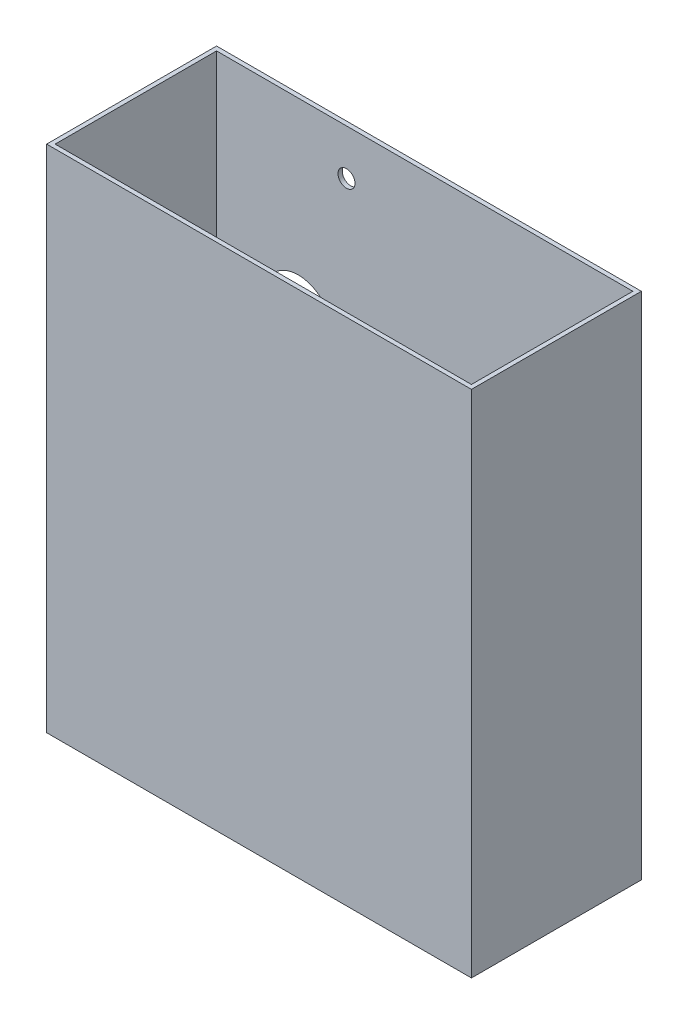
from build123d import *

# Parameters (mm, degrees)
SKETCH1_W           = 127
SKETCH1_H           = 50.8
BOSS_EXTRUDE1_DEPTH = 152.4
SKETCH2_W           = 124.46
SKETCH2_H           = 48.26
CUT_EXTRUDE1_DEPTH  = 149.86
SKETCH3_R           = 2.54
CUT_EXTRUDE3_DEPTH  = 2.54


with BuildPart() as part:
    # Sketch1 → Boss-Extrude1 (new body)
    with BuildSketch(Plane(origin=(0, 0, 0), x_dir=(1, 0, 0), z_dir=(0, 1, 0))):
        Rectangle(SKETCH1_W, SKETCH1_H)
    extrude(amount=BOSS_EXTRUDE1_DEPTH)

    # Sketch2 → Cut-Extrude1 (cut)
    with BuildSketch(Plane(origin=(0, 152.4, 0), x_dir=(1, 0, 0), z_dir=(0, 1, 0))):
        Rectangle(SKETCH2_W, SKETCH2_H)
    extrude(amount=-CUT_EXTRUDE1_DEPTH, mode=Mode.SUBTRACT)

    # Sketch3 → Cut-Extrude3 (cut)
    with BuildSketch(Plane(origin=(0, 0, -25.4), x_dir=(-1, 0, 0), z_dir=(0, 0, -1))):
        with BuildLine():
            ThreePointArc((47.928563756, 58.634922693), (44.952768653, 65.81912759), (37.768563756, 68.794922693))
            Line((37.768563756, 68.794922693), (37.768563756, 48.474922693))
            ThreePointArc((37.768563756, 48.474922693), (44.952768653, 51.450717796), (47.928563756, 58.634922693))
        make_face()
        with BuildLine():
            Line((37.768563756, 48.474922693), (37.768563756, 68.794922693))
            ThreePointArc((37.768563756, 68.794922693), (27.608563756, 58.634922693), (37.768563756, 48.474922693))
        make_face()
        with BuildLine():
            ThreePointArc((47.928563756, 58.634922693), (44.952768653, 65.81912759), (37.768563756, 68.794922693))
            Line((37.768563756, 68.794922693), (37.768563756, 48.474922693))
            ThreePointArc((37.768563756, 48.474922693), (44.952768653, 51.450717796), (47.928563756, 58.634922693))
        make_face()
        with BuildLine():
            Line((37.768563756, 48.474922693), (37.768563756, 68.794922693))
            ThreePointArc((37.768563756, 68.794922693), (27.608563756, 58.634922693), (37.768563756, 48.474922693))
        make_face()
        with BuildLine():
            ThreePointArc((47.962632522, 96.462030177), (44.974782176, 103.658270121), (37.768563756, 106.621973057))
            Line((37.768563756, 106.621973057), (37.768563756, 86.302087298))
            ThreePointArc((37.768563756, 86.302087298), (44.974782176, 89.265790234), (47.962632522, 96.462030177))
        make_face()
        with BuildLine():
            Line((37.768563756, 86.302087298), (37.768563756, 106.621973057))
            ThreePointArc((37.768563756, 106.621973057), (27.642632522, 96.462030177), (37.768563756, 86.302087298))
        make_face()
        with BuildLine():
            ThreePointArc((47.962632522, 96.462030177), (44.974782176, 103.658270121), (37.768563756, 106.621973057))
            Line((37.768563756, 106.621973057), (37.768563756, 86.302087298))
            ThreePointArc((37.768563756, 86.302087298), (44.974782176, 89.265790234), (47.962632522, 96.462030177))
        make_face()
        with BuildLine():
            Line((37.768563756, 86.302087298), (37.768563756, 106.621973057))
            ThreePointArc((37.768563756, 106.621973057), (27.642632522, 96.462030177), (37.768563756, 86.302087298))
        make_face()
        with BuildLine():
            ThreePointArc((48.944563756, 20.362037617), (45.671189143, 28.264663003), (37.768563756, 31.538037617))
            Line((37.768563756, 31.538037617), (37.768563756, 9.186037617))
            ThreePointArc((37.768563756, 9.186037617), (45.671189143, 12.45941223), (48.944563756, 20.362037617))
        make_face()
        with BuildLine():
            Line((37.768563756, 9.186037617), (37.768563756, 31.538037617))
            ThreePointArc((37.768563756, 31.538037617), (26.592563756, 20.362037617), (37.768563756, 9.186037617))
        make_face()
        with BuildLine():
            ThreePointArc((48.944563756, 20.362037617), (45.671189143, 28.264663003), (37.768563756, 31.538037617))
            Line((37.768563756, 31.538037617), (37.768563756, 9.186037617))
            ThreePointArc((37.768563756, 9.186037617), (45.671189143, 12.45941223), (48.944563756, 20.362037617))
        make_face()
        with BuildLine():
            Line((37.768563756, 9.186037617), (37.768563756, 31.538037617))
            ThreePointArc((37.768563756, 31.538037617), (26.592563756, 20.362037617), (37.768563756, 9.186037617))
        make_face()
        with Locations((23.377768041, 138.793670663)):
            Circle(SKETCH3_R)
    extrude(amount=-CUT_EXTRUDE3_DEPTH, mode=Mode.SUBTRACT)


solid = part.part
